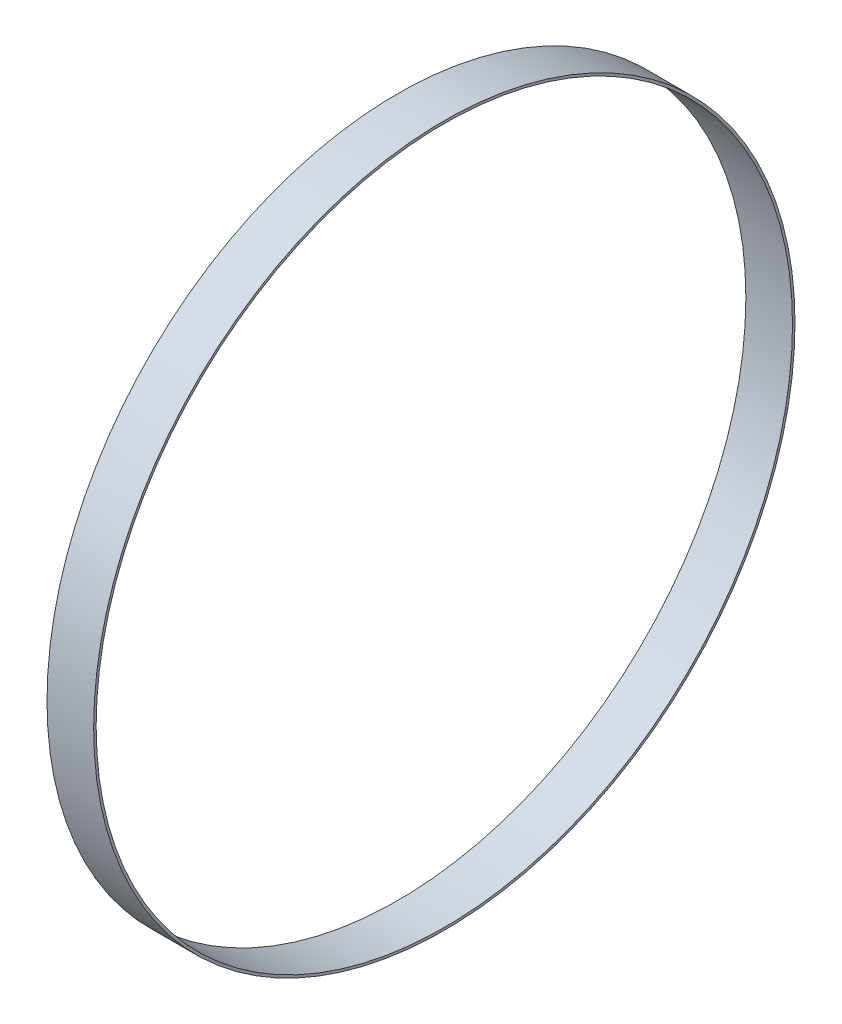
ISO-10303-21;
HEADER;
FILE_DESCRIPTION(('STEP AP214'),'2;1');
FILE_NAME('part.step','',(''),(''),'','','');
FILE_SCHEMA(('AUTOMOTIVE_DESIGN { 1 0 10303 214 1 1 1 1 }'));
ENDSEC;
DATA;
#1=APPLICATION_CONTEXT('core data for automotive mechanical design processes');
#2=APPLICATION_PROTOCOL_DEFINITION('international standard','automotive_design',2000,#1);
#3=PRODUCT_CONTEXT('',#1,'mechanical');
#4=PRODUCT('Part','Part','',(#3));
#5=PRODUCT_RELATED_PRODUCT_CATEGORY('part','',(#4));
#6=PRODUCT_DEFINITION_FORMATION('','',#4);
#7=PRODUCT_DEFINITION_CONTEXT('part definition',#1,'design');
#8=PRODUCT_DEFINITION('design','',#6,#7);
#9=PRODUCT_DEFINITION_SHAPE('','',#8);
#10=(LENGTH_UNIT() NAMED_UNIT(*) SI_UNIT(.MILLI.,.METRE.));
#11=(NAMED_UNIT(*) PLANE_ANGLE_UNIT() SI_UNIT($,.RADIAN.));
#12=(NAMED_UNIT(*) SI_UNIT($,.STERADIAN.) SOLID_ANGLE_UNIT());
#13=UNCERTAINTY_MEASURE_WITH_UNIT(LENGTH_MEASURE(1.E-05),#10,'distance_accuracy_value','');
#14=(GEOMETRIC_REPRESENTATION_CONTEXT(3) GLOBAL_UNCERTAINTY_ASSIGNED_CONTEXT((#13)) GLOBAL_UNIT_ASSIGNED_CONTEXT((#10,
#11,#12)) REPRESENTATION_CONTEXT('',''));
#15=CARTESIAN_POINT('',(0.,0.,0.));
#16=DIRECTION('',(0.,0.,1.));
#17=DIRECTION('',(1.,0.,0.));
#18=AXIS2_PLACEMENT_3D('',#15,#16,#17);
#19=CARTESIAN_POINT('',(-177.8,1336.675,0.));
#20=DIRECTION('',(1.,0.,0.));
#21=DIRECTION('',(0.,0.,-1.));
#22=AXIS2_PLACEMENT_3D('',#19,#20,#21);
#23=PLANE('',#22);
#24=CARTESIAN_POINT('',(-177.8,0.,0.));
#25=DIRECTION('',(-1.,0.,0.));
#26=DIRECTION('',(0.,0.,1.));
#27=AXIS2_PLACEMENT_3D('',#24,#25,#26);
#28=CIRCLE('',#27,1327.15);
#29=CARTESIAN_POINT('',(-177.8,0.,1327.15));
#30=VERTEX_POINT('',#29);
#31=EDGE_CURVE('E10',#30,#30,#28,.T.);
#32=ORIENTED_EDGE('',*,*,#31,.F.);
#33=EDGE_LOOP('',(#32));
#34=FACE_BOUND('',#33,.T.);
#35=CARTESIAN_POINT('',(-177.8,0.,0.));
#36=DIRECTION('',(-1.,0.,0.));
#37=DIRECTION('',(0.,0.,1.));
#38=AXIS2_PLACEMENT_3D('',#35,#36,#37);
#39=CIRCLE('',#38,1336.675);
#40=CARTESIAN_POINT('',(-177.8,0.,1336.675));
#41=VERTEX_POINT('',#40);
#42=EDGE_CURVE('E29',#41,#41,#39,.T.);
#43=ORIENTED_EDGE('',*,*,#42,.T.);
#44=EDGE_LOOP('',(#43));
#45=FACE_BOUND('',#44,.T.);
#46=ADVANCED_FACE('F15',(#34,#45),#23,.F.);
#47=CARTESIAN_POINT('',(-84.2070540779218,0.,0.));
#48=DIRECTION('',(-1.,0.,0.));
#49=DIRECTION('',(0.,0.,1.));
#50=AXIS2_PLACEMENT_3D('',#47,#48,#49);
#51=CYLINDRICAL_SURFACE('',#50,1327.15);
#52=CARTESIAN_POINT('',(0.,0.,0.));
#53=DIRECTION('',(-1.,0.,0.));
#54=DIRECTION('',(0.,0.,1.));
#55=AXIS2_PLACEMENT_3D('',#52,#53,#54);
#56=CIRCLE('',#55,1327.15);
#57=CARTESIAN_POINT('',(0.,0.,1327.15));
#58=VERTEX_POINT('',#57);
#59=EDGE_CURVE('E21',#58,#58,#56,.T.);
#60=ORIENTED_EDGE('',*,*,#59,.F.);
#61=EDGE_LOOP('',(#60));
#62=FACE_BOUND('',#61,.T.);
#63=ORIENTED_EDGE('',*,*,#31,.T.);
#64=EDGE_LOOP('',(#63));
#65=FACE_BOUND('',#64,.T.);
#66=ADVANCED_FACE('F44',(#62,#65),#51,.F.);
#67=CARTESIAN_POINT('',(0.,1336.675,0.));
#68=DIRECTION('',(-1.,0.,0.));
#69=DIRECTION('',(0.,0.,1.));
#70=AXIS2_PLACEMENT_3D('',#67,#68,#69);
#71=PLANE('',#70);
#72=CARTESIAN_POINT('',(0.,0.,0.));
#73=DIRECTION('',(-1.,0.,0.));
#74=DIRECTION('',(0.,0.,1.));
#75=AXIS2_PLACEMENT_3D('',#72,#73,#74);
#76=CIRCLE('',#75,1336.675);
#77=CARTESIAN_POINT('',(0.,0.,1336.675));
#78=VERTEX_POINT('',#77);
#79=EDGE_CURVE('E25',#78,#78,#76,.T.);
#80=ORIENTED_EDGE('',*,*,#79,.F.);
#81=EDGE_LOOP('',(#80));
#82=FACE_BOUND('',#81,.T.);
#83=ORIENTED_EDGE('',*,*,#59,.T.);
#84=EDGE_LOOP('',(#83));
#85=FACE_BOUND('',#84,.T.);
#86=ADVANCED_FACE('F39',(#82,#85),#71,.F.);
#87=CARTESIAN_POINT('',(-84.2070540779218,0.,0.));
#88=DIRECTION('',(-1.,0.,0.));
#89=DIRECTION('',(0.,0.,1.));
#90=AXIS2_PLACEMENT_3D('',#87,#88,#89);
#91=CYLINDRICAL_SURFACE('',#90,1336.675);
#92=ORIENTED_EDGE('',*,*,#42,.F.);
#93=EDGE_LOOP('',(#92));
#94=FACE_BOUND('',#93,.T.);
#95=ORIENTED_EDGE('',*,*,#79,.T.);
#96=EDGE_LOOP('',(#95));
#97=FACE_BOUND('',#96,.T.);
#98=ADVANCED_FACE('F36',(#94,#97),#91,.T.);
#99=CLOSED_SHELL('',(#46,#66,#86,#98));
#100=MANIFOLD_SOLID_BREP('B1',#99);
#101=ADVANCED_BREP_SHAPE_REPRESENTATION('',(#18,#100),#14);
#102=SHAPE_DEFINITION_REPRESENTATION(#9,#101);
ENDSEC;
END-ISO-10303-21;
